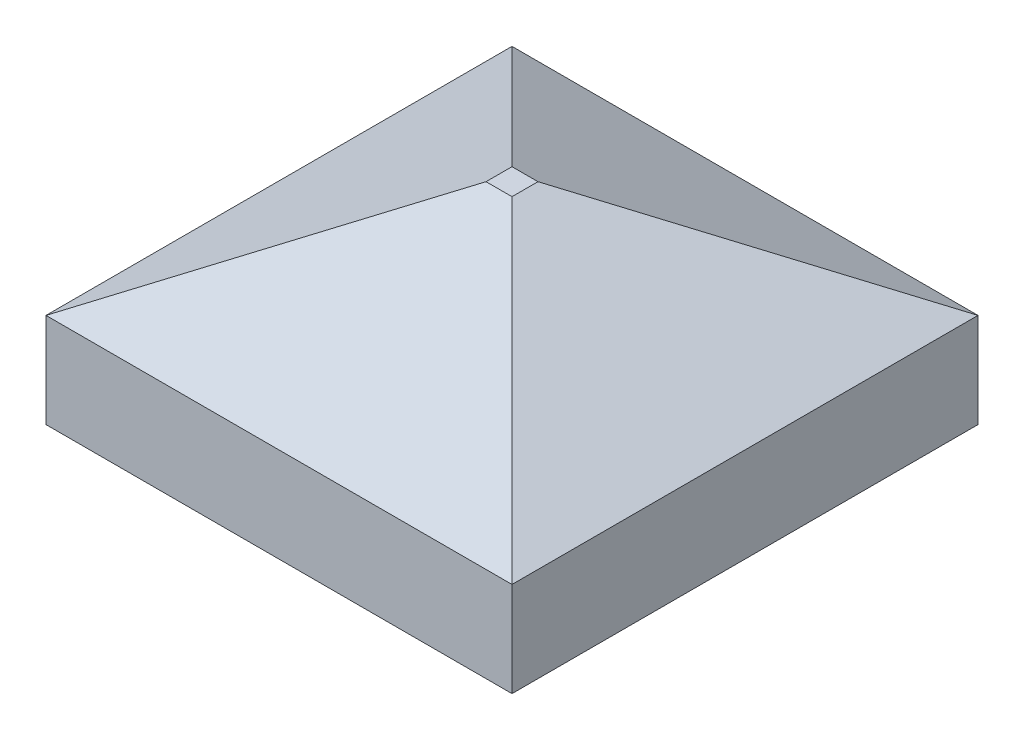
ISO-10303-21;
HEADER;
FILE_DESCRIPTION(('STEP AP214'),'2;1');
FILE_NAME('part.step','',(''),(''),'','','');
FILE_SCHEMA(('AUTOMOTIVE_DESIGN { 1 0 10303 214 1 1 1 1 }'));
ENDSEC;
DATA;
#1=APPLICATION_CONTEXT('core data for automotive mechanical design processes');
#2=APPLICATION_PROTOCOL_DEFINITION('international standard','automotive_design',2000,#1);
#3=PRODUCT_CONTEXT('',#1,'mechanical');
#4=PRODUCT('Part','Part','',(#3));
#5=PRODUCT_RELATED_PRODUCT_CATEGORY('part','',(#4));
#6=PRODUCT_DEFINITION_FORMATION('','',#4);
#7=PRODUCT_DEFINITION_CONTEXT('part definition',#1,'design');
#8=PRODUCT_DEFINITION('design','',#6,#7);
#9=PRODUCT_DEFINITION_SHAPE('','',#8);
#10=(LENGTH_UNIT() NAMED_UNIT(*) SI_UNIT(.MILLI.,.METRE.));
#11=(NAMED_UNIT(*) PLANE_ANGLE_UNIT() SI_UNIT($,.RADIAN.));
#12=(NAMED_UNIT(*) SI_UNIT($,.STERADIAN.) SOLID_ANGLE_UNIT());
#13=UNCERTAINTY_MEASURE_WITH_UNIT(LENGTH_MEASURE(1.E-05),#10,'distance_accuracy_value','');
#14=(GEOMETRIC_REPRESENTATION_CONTEXT(3) GLOBAL_UNCERTAINTY_ASSIGNED_CONTEXT((#13)) GLOBAL_UNIT_ASSIGNED_CONTEXT((#10,
#11,#12)) REPRESENTATION_CONTEXT('',''));
#15=CARTESIAN_POINT('',(0.,0.,0.));
#16=DIRECTION('',(0.,0.,1.));
#17=DIRECTION('',(1.,0.,0.));
#18=AXIS2_PLACEMENT_3D('',#15,#16,#17);
#19=CARTESIAN_POINT('',(0.,0.,0.));
#20=DIRECTION('',(0.,-1.,0.));
#21=DIRECTION('',(0.,0.,-1.));
#22=AXIS2_PLACEMENT_3D('',#19,#20,#21);
#23=PLANE('',#22);
#24=DIRECTION('',(0.,0.,-1.));
#25=VECTOR('',#24,1.);
#26=CARTESIAN_POINT('',(51.5,0.,0.));
#27=LINE('',#26,#25);
#28=CARTESIAN_POINT('',(51.5,0.,51.5));
#29=VERTEX_POINT('',#28);
#30=CARTESIAN_POINT('',(51.5,0.,-51.5));
#31=VERTEX_POINT('',#30);
#32=EDGE_CURVE('E111',#29,#31,#27,.T.);
#33=ORIENTED_EDGE('',*,*,#32,.F.);
#34=DIRECTION('',(1.,0.,0.));
#35=VECTOR('',#34,1.);
#36=CARTESIAN_POINT('',(0.,0.,51.5));
#37=LINE('',#36,#35);
#38=CARTESIAN_POINT('',(-51.5,0.,51.5));
#39=VERTEX_POINT('',#38);
#40=EDGE_CURVE('E132',#39,#29,#37,.T.);
#41=ORIENTED_EDGE('',*,*,#40,.F.);
#42=DIRECTION('',(0.,0.,1.));
#43=VECTOR('',#42,1.);
#44=CARTESIAN_POINT('',(-51.5,0.,0.));
#45=LINE('',#44,#43);
#46=CARTESIAN_POINT('',(-51.5,0.,-51.5));
#47=VERTEX_POINT('',#46);
#48=EDGE_CURVE('E113',#47,#39,#45,.T.);
#49=ORIENTED_EDGE('',*,*,#48,.F.);
#50=DIRECTION('',(-1.,0.,0.));
#51=VECTOR('',#50,1.);
#52=CARTESIAN_POINT('',(0.,0.,-51.5));
#53=LINE('',#52,#51);
#54=EDGE_CURVE('E52',#31,#47,#53,.T.);
#55=ORIENTED_EDGE('',*,*,#54,.F.);
#56=EDGE_LOOP('',(#33,#41,#49,#55));
#57=FACE_BOUND('',#56,.T.);
#58=DIRECTION('',(1.,0.,0.));
#59=VECTOR('',#58,1.);
#60=CARTESIAN_POINT('',(-50.,0.,50.));
#61=LINE('',#60,#59);
#62=CARTESIAN_POINT('',(-50.,0.,50.));
#63=VERTEX_POINT('',#62);
#64=CARTESIAN_POINT('',(50.,0.,50.));
#65=VERTEX_POINT('',#64);
#66=EDGE_CURVE('E189',#63,#65,#61,.T.);
#67=ORIENTED_EDGE('',*,*,#66,.T.);
#68=DIRECTION('',(0.,0.,-1.));
#69=VECTOR('',#68,1.);
#70=CARTESIAN_POINT('',(50.,0.,50.));
#71=LINE('',#70,#69);
#72=CARTESIAN_POINT('',(50.,0.,-50.));
#73=VERTEX_POINT('',#72);
#74=EDGE_CURVE('E211',#65,#73,#71,.T.);
#75=ORIENTED_EDGE('',*,*,#74,.T.);
#76=DIRECTION('',(-1.,0.,0.));
#77=VECTOR('',#76,1.);
#78=CARTESIAN_POINT('',(-50.,0.,-50.));
#79=LINE('',#78,#77);
#80=CARTESIAN_POINT('',(-50.,0.,-50.));
#81=VERTEX_POINT('',#80);
#82=EDGE_CURVE('E208',#73,#81,#79,.T.);
#83=ORIENTED_EDGE('',*,*,#82,.T.);
#84=DIRECTION('',(0.,0.,1.));
#85=VECTOR('',#84,1.);
#86=CARTESIAN_POINT('',(-50.,0.,50.));
#87=LINE('',#86,#85);
#88=EDGE_CURVE('E67',#81,#63,#87,.T.);
#89=ORIENTED_EDGE('',*,*,#88,.T.);
#90=EDGE_LOOP('',(#67,#75,#83,#89));
#91=FACE_BOUND('',#90,.T.);
#92=ADVANCED_FACE('F47',(#57,#91),#23,.T.);
#93=CARTESIAN_POINT('',(51.5,20.,50.));
#94=DIRECTION('',(-1.,0.,0.));
#95=DIRECTION('',(0.,0.,1.));
#96=AXIS2_PLACEMENT_3D('',#93,#94,#95);
#97=PLANE('',#96);
#98=ORIENTED_EDGE('',*,*,#32,.T.);
#99=DIRECTION('',(0.,-1.,0.));
#100=VECTOR('',#99,1.);
#101=CARTESIAN_POINT('',(51.5,20.,-51.5));
#102=LINE('',#101,#100);
#103=CARTESIAN_POINT('',(51.5,20.9055982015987,-51.5));
#104=VERTEX_POINT('',#103);
#105=EDGE_CURVE('E12',#104,#31,#102,.T.);
#106=ORIENTED_EDGE('',*,*,#105,.F.);
#107=DIRECTION('',(0.,0.,-1.));
#108=VECTOR('',#107,1.);
#109=CARTESIAN_POINT('',(51.5,20.9055982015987,0.));
#110=LINE('',#109,#108);
#111=CARTESIAN_POINT('',(51.5,20.9055982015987,51.5));
#112=VERTEX_POINT('',#111);
#113=EDGE_CURVE('E135',#112,#104,#110,.T.);
#114=ORIENTED_EDGE('',*,*,#113,.F.);
#115=DIRECTION('',(0.,-1.,0.));
#116=VECTOR('',#115,1.);
#117=CARTESIAN_POINT('',(51.5,20.,51.5));
#118=LINE('',#117,#116);
#119=EDGE_CURVE('E73',#112,#29,#118,.T.);
#120=ORIENTED_EDGE('',*,*,#119,.T.);
#121=EDGE_LOOP('',(#98,#106,#114,#120));
#122=FACE_BOUND('',#121,.T.);
#123=ADVANCED_FACE('F123',(#122),#97,.F.);
#124=CARTESIAN_POINT('',(-50.,20.,-51.5));
#125=DIRECTION('',(0.,0.,1.));
#126=DIRECTION('',(1.,0.,0.));
#127=AXIS2_PLACEMENT_3D('',#124,#125,#126);
#128=PLANE('',#127);
#129=ORIENTED_EDGE('',*,*,#54,.T.);
#130=DIRECTION('',(0.,-1.,0.));
#131=VECTOR('',#130,1.);
#132=CARTESIAN_POINT('',(-51.5,20.,-51.5));
#133=LINE('',#132,#131);
#134=CARTESIAN_POINT('',(-51.5,20.9055982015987,-51.5));
#135=VERTEX_POINT('',#134);
#136=EDGE_CURVE('E59',#135,#47,#133,.T.);
#137=ORIENTED_EDGE('',*,*,#136,.F.);
#138=DIRECTION('',(-1.,0.,0.));
#139=VECTOR('',#138,1.);
#140=CARTESIAN_POINT('',(0.,20.9055982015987,-51.5));
#141=LINE('',#140,#139);
#142=EDGE_CURVE('E124',#104,#135,#141,.T.);
#143=ORIENTED_EDGE('',*,*,#142,.F.);
#144=ORIENTED_EDGE('',*,*,#105,.T.);
#145=EDGE_LOOP('',(#129,#137,#143,#144));
#146=FACE_BOUND('',#145,.T.);
#147=ADVANCED_FACE('F120',(#146),#128,.F.);
#148=CARTESIAN_POINT('',(-51.5,20.,50.));
#149=DIRECTION('',(1.,0.,0.));
#150=DIRECTION('',(0.,0.,-1.));
#151=AXIS2_PLACEMENT_3D('',#148,#149,#150);
#152=PLANE('',#151);
#153=ORIENTED_EDGE('',*,*,#48,.T.);
#154=DIRECTION('',(0.,-1.,0.));
#155=VECTOR('',#154,1.);
#156=CARTESIAN_POINT('',(-51.5,20.,51.5));
#157=LINE('',#156,#155);
#158=CARTESIAN_POINT('',(-51.5,20.9055982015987,51.5));
#159=VERTEX_POINT('',#158);
#160=EDGE_CURVE('E138',#159,#39,#157,.T.);
#161=ORIENTED_EDGE('',*,*,#160,.F.);
#162=DIRECTION('',(0.,0.,1.));
#163=VECTOR('',#162,1.);
#164=CARTESIAN_POINT('',(-51.5,20.9055982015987,0.));
#165=LINE('',#164,#163);
#166=EDGE_CURVE('E149',#135,#159,#165,.T.);
#167=ORIENTED_EDGE('',*,*,#166,.F.);
#168=ORIENTED_EDGE('',*,*,#136,.T.);
#169=EDGE_LOOP('',(#153,#161,#167,#168));
#170=FACE_BOUND('',#169,.T.);
#171=ADVANCED_FACE('F137',(#170),#152,.F.);
#172=CARTESIAN_POINT('',(-50.,20.,51.5));
#173=DIRECTION('',(0.,0.,-1.));
#174=DIRECTION('',(-1.,0.,0.));
#175=AXIS2_PLACEMENT_3D('',#172,#173,#174);
#176=PLANE('',#175);
#177=ORIENTED_EDGE('',*,*,#40,.T.);
#178=ORIENTED_EDGE('',*,*,#119,.F.);
#179=DIRECTION('',(1.,0.,0.));
#180=VECTOR('',#179,1.);
#181=CARTESIAN_POINT('',(0.,20.9055982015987,51.5));
#182=LINE('',#181,#180);
#183=EDGE_CURVE('E142',#159,#112,#182,.T.);
#184=ORIENTED_EDGE('',*,*,#183,.F.);
#185=ORIENTED_EDGE('',*,*,#160,.T.);
#186=EDGE_LOOP('',(#177,#178,#184,#185));
#187=FACE_BOUND('',#186,.T.);
#188=ADVANCED_FACE('F140',(#187),#176,.F.);
#189=CARTESIAN_POINT('',(0.,46.5,0.));
#190=DIRECTION('',(0.,-1.,0.));
#191=DIRECTION('',(0.,0.,-1.));
#192=AXIS2_PLACEMENT_3D('',#189,#190,#191);
#193=PLANE('',#192);
#194=DIRECTION('',(0.,0.,-1.));
#195=VECTOR('',#194,1.);
#196=CARTESIAN_POINT('',(2.87063658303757,46.5,0.));
#197=LINE('',#196,#195);
#198=CARTESIAN_POINT('',(2.87063658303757,46.5,2.87063658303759));
#199=VERTEX_POINT('',#198);
#200=CARTESIAN_POINT('',(2.87063658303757,46.5,-2.87063658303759));
#201=VERTEX_POINT('',#200);
#202=EDGE_CURVE('E159',#199,#201,#197,.T.);
#203=ORIENTED_EDGE('',*,*,#202,.T.);
#204=DIRECTION('',(-1.,0.,0.));
#205=VECTOR('',#204,1.);
#206=CARTESIAN_POINT('',(0.,46.5,-2.87063658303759));
#207=LINE('',#206,#205);
#208=CARTESIAN_POINT('',(-2.87063658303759,46.5,-2.87063658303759));
#209=VERTEX_POINT('',#208);
#210=EDGE_CURVE('E162',#201,#209,#207,.T.);
#211=ORIENTED_EDGE('',*,*,#210,.T.);
#212=DIRECTION('',(0.,0.,1.));
#213=VECTOR('',#212,1.);
#214=CARTESIAN_POINT('',(-2.87063658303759,46.5,0.));
#215=LINE('',#214,#213);
#216=CARTESIAN_POINT('',(-2.87063658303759,46.5,2.87063658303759));
#217=VERTEX_POINT('',#216);
#218=EDGE_CURVE('E158',#209,#217,#215,.T.);
#219=ORIENTED_EDGE('',*,*,#218,.T.);
#220=DIRECTION('',(1.,0.,0.));
#221=VECTOR('',#220,1.);
#222=CARTESIAN_POINT('',(0.,46.5,2.87063658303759));
#223=LINE('',#222,#221);
#224=EDGE_CURVE('E156',#217,#199,#223,.T.);
#225=ORIENTED_EDGE('',*,*,#224,.T.);
#226=EDGE_LOOP('',(#203,#211,#219,#225));
#227=FACE_BOUND('',#226,.T.);
#228=ADVANCED_FACE('F166',(#227),#193,.F.);
#229=CARTESIAN_POINT('',(0.,37.5963578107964,19.7875567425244));
#230=DIRECTION('',(0.,-0.884918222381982,-0.465746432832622));
#231=DIRECTION('',(0.,0.465746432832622,-0.884918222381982));
#232=AXIS2_PLACEMENT_3D('',#229,#230,#231);
#233=PLANE('',#232);
#234=DIRECTION('',(-0.662701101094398,0.348790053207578,-0.662701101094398));
#235=VECTOR('',#234,1.);
#236=CARTESIAN_POINT('',(11.0974010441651,42.1701239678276,11.0974010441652));
#237=LINE('',#236,#235);
#238=EDGE_CURVE('E155',#112,#199,#237,.T.);
#239=ORIENTED_EDGE('',*,*,#238,.T.);
#240=ORIENTED_EDGE('',*,*,#224,.F.);
#241=DIRECTION('',(0.662701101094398,0.348790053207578,-0.662701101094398));
#242=VECTOR('',#241,1.);
#243=CARTESIAN_POINT('',(-11.0974010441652,42.1701239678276,11.0974010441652));
#244=LINE('',#243,#242);
#245=EDGE_CURVE('E154',#159,#217,#244,.T.);
#246=ORIENTED_EDGE('',*,*,#245,.F.);
#247=ORIENTED_EDGE('',*,*,#183,.T.);
#248=EDGE_LOOP('',(#239,#240,#246,#247));
#249=FACE_BOUND('',#248,.T.);
#250=ADVANCED_FACE('F399',(#249),#233,.F.);
#251=CARTESIAN_POINT('',(-19.7875567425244,37.5963578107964,0.));
#252=DIRECTION('',(0.465746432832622,-0.884918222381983,0.));
#253=DIRECTION('',(0.884918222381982,0.465746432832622,0.));
#254=AXIS2_PLACEMENT_3D('',#251,#252,#253);
#255=PLANE('',#254);
#256=ORIENTED_EDGE('',*,*,#245,.T.);
#257=ORIENTED_EDGE('',*,*,#218,.F.);
#258=DIRECTION('',(0.662701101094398,0.348790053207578,0.662701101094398));
#259=VECTOR('',#258,1.);
#260=CARTESIAN_POINT('',(-11.0974010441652,42.1701239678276,-11.0974010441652));
#261=LINE('',#260,#259);
#262=EDGE_CURVE('E127',#135,#209,#261,.T.);
#263=ORIENTED_EDGE('',*,*,#262,.F.);
#264=ORIENTED_EDGE('',*,*,#166,.T.);
#265=EDGE_LOOP('',(#256,#257,#263,#264));
#266=FACE_BOUND('',#265,.T.);
#267=ADVANCED_FACE('F173',(#266),#255,.F.);
#268=CARTESIAN_POINT('',(19.7875567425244,37.5963578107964,0.));
#269=DIRECTION('',(-0.465746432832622,-0.884918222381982,0.));
#270=DIRECTION('',(0.884918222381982,-0.465746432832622,0.));
#271=AXIS2_PLACEMENT_3D('',#268,#269,#270);
#272=PLANE('',#271);
#273=DIRECTION('',(-0.662701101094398,0.348790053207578,0.662701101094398));
#274=VECTOR('',#273,1.);
#275=CARTESIAN_POINT('',(11.0974010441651,42.1701239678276,-11.0974010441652));
#276=LINE('',#275,#274);
#277=EDGE_CURVE('E129',#104,#201,#276,.T.);
#278=ORIENTED_EDGE('',*,*,#277,.T.);
#279=ORIENTED_EDGE('',*,*,#202,.F.);
#280=ORIENTED_EDGE('',*,*,#238,.F.);
#281=ORIENTED_EDGE('',*,*,#113,.T.);
#282=EDGE_LOOP('',(#278,#279,#280,#281));
#283=FACE_BOUND('',#282,.T.);
#284=ADVANCED_FACE('F405',(#283),#272,.F.);
#285=CARTESIAN_POINT('',(0.,37.5963578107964,-19.7875567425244));
#286=DIRECTION('',(0.,-0.884918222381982,0.465746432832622));
#287=DIRECTION('',(0.,-0.465746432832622,-0.884918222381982));
#288=AXIS2_PLACEMENT_3D('',#285,#286,#287);
#289=PLANE('',#288);
#290=ORIENTED_EDGE('',*,*,#262,.T.);
#291=ORIENTED_EDGE('',*,*,#210,.F.);
#292=ORIENTED_EDGE('',*,*,#277,.F.);
#293=ORIENTED_EDGE('',*,*,#142,.T.);
#294=EDGE_LOOP('',(#290,#291,#292,#293));
#295=FACE_BOUND('',#294,.T.);
#296=ADVANCED_FACE('F51',(#295),#289,.F.);
#297=CARTESIAN_POINT('',(50.,20.,50.));
#298=DIRECTION('',(-1.,0.,0.));
#299=DIRECTION('',(0.,0.,1.));
#300=AXIS2_PLACEMENT_3D('',#297,#298,#299);
#301=PLANE('',#300);
#302=ORIENTED_EDGE('',*,*,#74,.F.);
#303=DIRECTION('',(0.,-1.,0.));
#304=VECTOR('',#303,1.);
#305=CARTESIAN_POINT('',(50.,20.,50.));
#306=LINE('',#305,#304);
#307=CARTESIAN_POINT('',(50.,20.,50.));
#308=VERTEX_POINT('',#307);
#309=EDGE_CURVE('E191',#308,#65,#306,.T.);
#310=ORIENTED_EDGE('',*,*,#309,.F.);
#311=DIRECTION('',(0.,0.,1.));
#312=VECTOR('',#311,1.);
#313=CARTESIAN_POINT('',(50.,20.,0.));
#314=LINE('',#313,#312);
#315=CARTESIAN_POINT('',(50.,20.,-50.));
#316=VERTEX_POINT('',#315);
#317=EDGE_CURVE('E181',#308,#316,#314,.F.);
#318=ORIENTED_EDGE('',*,*,#317,.T.);
#319=DIRECTION('',(0.,-1.,0.));
#320=VECTOR('',#319,1.);
#321=CARTESIAN_POINT('',(50.,20.,-50.));
#322=LINE('',#321,#320);
#323=EDGE_CURVE('E163',#316,#73,#322,.T.);
#324=ORIENTED_EDGE('',*,*,#323,.T.);
#325=EDGE_LOOP('',(#302,#310,#318,#324));
#326=FACE_BOUND('',#325,.T.);
#327=ADVANCED_FACE('F355',(#326),#301,.T.);
#328=CARTESIAN_POINT('',(-50.,20.,-50.));
#329=DIRECTION('',(0.,0.,1.));
#330=DIRECTION('',(1.,0.,0.));
#331=AXIS2_PLACEMENT_3D('',#328,#329,#330);
#332=PLANE('',#331);
#333=ORIENTED_EDGE('',*,*,#82,.F.);
#334=ORIENTED_EDGE('',*,*,#323,.F.);
#335=DIRECTION('',(1.,0.,0.));
#336=VECTOR('',#335,1.);
#337=CARTESIAN_POINT('',(0.,20.,-50.));
#338=LINE('',#337,#336);
#339=CARTESIAN_POINT('',(-50.,20.,-50.));
#340=VERTEX_POINT('',#339);
#341=EDGE_CURVE('E188',#316,#340,#338,.F.);
#342=ORIENTED_EDGE('',*,*,#341,.T.);
#343=DIRECTION('',(0.,-1.,0.));
#344=VECTOR('',#343,1.);
#345=CARTESIAN_POINT('',(-50.,20.,-50.));
#346=LINE('',#345,#344);
#347=EDGE_CURVE('E197',#340,#81,#346,.T.);
#348=ORIENTED_EDGE('',*,*,#347,.T.);
#349=EDGE_LOOP('',(#333,#334,#342,#348));
#350=FACE_BOUND('',#349,.T.);
#351=ADVANCED_FACE('F406',(#350),#332,.T.);
#352=CARTESIAN_POINT('',(-50.,20.,50.));
#353=DIRECTION('',(1.,0.,0.));
#354=DIRECTION('',(0.,0.,-1.));
#355=AXIS2_PLACEMENT_3D('',#352,#353,#354);
#356=PLANE('',#355);
#357=ORIENTED_EDGE('',*,*,#88,.F.);
#358=ORIENTED_EDGE('',*,*,#347,.F.);
#359=DIRECTION('',(0.,0.,1.));
#360=VECTOR('',#359,1.);
#361=CARTESIAN_POINT('',(-50.,20.,0.));
#362=LINE('',#361,#360);
#363=CARTESIAN_POINT('',(-50.,20.,50.));
#364=VERTEX_POINT('',#363);
#365=EDGE_CURVE('E192',#340,#364,#362,.T.);
#366=ORIENTED_EDGE('',*,*,#365,.T.);
#367=DIRECTION('',(0.,-1.,0.));
#368=VECTOR('',#367,1.);
#369=CARTESIAN_POINT('',(-50.,20.,50.));
#370=LINE('',#369,#368);
#371=EDGE_CURVE('E200',#364,#63,#370,.T.);
#372=ORIENTED_EDGE('',*,*,#371,.T.);
#373=EDGE_LOOP('',(#357,#358,#366,#372));
#374=FACE_BOUND('',#373,.T.);
#375=ADVANCED_FACE('F413',(#374),#356,.T.);
#376=CARTESIAN_POINT('',(-50.,20.,50.));
#377=DIRECTION('',(0.,0.,-1.));
#378=DIRECTION('',(-1.,0.,0.));
#379=AXIS2_PLACEMENT_3D('',#376,#377,#378);
#380=PLANE('',#379);
#381=ORIENTED_EDGE('',*,*,#66,.F.);
#382=ORIENTED_EDGE('',*,*,#371,.F.);
#383=DIRECTION('',(1.,0.,0.));
#384=VECTOR('',#383,1.);
#385=CARTESIAN_POINT('',(0.,20.,50.));
#386=LINE('',#385,#384);
#387=EDGE_CURVE('E187',#364,#308,#386,.T.);
#388=ORIENTED_EDGE('',*,*,#387,.T.);
#389=ORIENTED_EDGE('',*,*,#309,.T.);
#390=EDGE_LOOP('',(#381,#382,#388,#389));
#391=FACE_BOUND('',#390,.T.);
#392=ADVANCED_FACE('F232',(#391),#380,.T.);
#393=CARTESIAN_POINT('',(0.,45.,0.));
#394=DIRECTION('',(0.,-1.,0.));
#395=DIRECTION('',(0.,0.,-1.));
#396=AXIS2_PLACEMENT_3D('',#393,#394,#395);
#397=PLANE('',#396);
#398=DIRECTION('',(0.,0.,-1.));
#399=VECTOR('',#398,1.);
#400=CARTESIAN_POINT('',(2.5,45.,2.5));
#401=LINE('',#400,#399);
#402=CARTESIAN_POINT('',(2.5,45.,2.5));
#403=VERTEX_POINT('',#402);
#404=CARTESIAN_POINT('',(2.5,45.,-2.5));
#405=VERTEX_POINT('',#404);
#406=EDGE_CURVE('E265',#403,#405,#401,.T.);
#407=ORIENTED_EDGE('',*,*,#406,.F.);
#408=DIRECTION('',(1.,0.,0.));
#409=VECTOR('',#408,1.);
#410=CARTESIAN_POINT('',(-2.5,45.,2.5));
#411=LINE('',#410,#409);
#412=CARTESIAN_POINT('',(-2.5,45.,2.5));
#413=VERTEX_POINT('',#412);
#414=EDGE_CURVE('E266',#413,#403,#411,.T.);
#415=ORIENTED_EDGE('',*,*,#414,.F.);
#416=DIRECTION('',(0.,0.,1.));
#417=VECTOR('',#416,1.);
#418=CARTESIAN_POINT('',(-2.5,45.,2.5));
#419=LINE('',#418,#417);
#420=CARTESIAN_POINT('',(-2.5,45.,-2.5));
#421=VERTEX_POINT('',#420);
#422=EDGE_CURVE('E261',#421,#413,#419,.T.);
#423=ORIENTED_EDGE('',*,*,#422,.F.);
#424=DIRECTION('',(-1.,0.,0.));
#425=VECTOR('',#424,1.);
#426=CARTESIAN_POINT('',(-2.5,45.,-2.5));
#427=LINE('',#426,#425);
#428=EDGE_CURVE('E255',#405,#421,#427,.T.);
#429=ORIENTED_EDGE('',*,*,#428,.F.);
#430=EDGE_LOOP('',(#407,#415,#423,#429));
#431=FACE_BOUND('',#430,.T.);
#432=ADVANCED_FACE('F222',(#431),#397,.T.);
#433=CARTESIAN_POINT('',(0.,36.2689804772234,19.0889370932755));
#434=DIRECTION('',(0.,-0.884918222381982,-0.465746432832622));
#435=DIRECTION('',(0.,0.465746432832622,-0.884918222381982));
#436=AXIS2_PLACEMENT_3D('',#433,#434,#435);
#437=PLANE('',#436);
#438=DIRECTION('',(-0.662701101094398,0.348790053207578,-0.662701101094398));
#439=VECTOR('',#438,1.);
#440=CARTESIAN_POINT('',(50.,20.,50.));
#441=LINE('',#440,#439);
#442=EDGE_CURVE('E285',#308,#403,#441,.T.);
#443=ORIENTED_EDGE('',*,*,#442,.F.);
#444=ORIENTED_EDGE('',*,*,#387,.F.);
#445=DIRECTION('',(0.662701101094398,0.348790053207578,-0.662701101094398));
#446=VECTOR('',#445,1.);
#447=CARTESIAN_POINT('',(-50.,20.,50.));
#448=LINE('',#447,#446);
#449=EDGE_CURVE('E291',#364,#413,#448,.T.);
#450=ORIENTED_EDGE('',*,*,#449,.T.);
#451=ORIENTED_EDGE('',*,*,#414,.T.);
#452=EDGE_LOOP('',(#443,#444,#450,#451));
#453=FACE_BOUND('',#452,.T.);
#454=ADVANCED_FACE('F230',(#453),#437,.T.);
#455=CARTESIAN_POINT('',(-19.0889370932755,36.2689804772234,0.));
#456=DIRECTION('',(0.465746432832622,-0.884918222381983,0.));
#457=DIRECTION('',(0.884918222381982,0.465746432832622,0.));
#458=AXIS2_PLACEMENT_3D('',#455,#456,#457);
#459=PLANE('',#458);
#460=ORIENTED_EDGE('',*,*,#449,.F.);
#461=ORIENTED_EDGE('',*,*,#365,.F.);
#462=DIRECTION('',(0.662701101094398,0.348790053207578,0.662701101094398));
#463=VECTOR('',#462,1.);
#464=CARTESIAN_POINT('',(-50.,20.,-50.));
#465=LINE('',#464,#463);
#466=EDGE_CURVE('E212',#340,#421,#465,.T.);
#467=ORIENTED_EDGE('',*,*,#466,.T.);
#468=ORIENTED_EDGE('',*,*,#422,.T.);
#469=EDGE_LOOP('',(#460,#461,#467,#468));
#470=FACE_BOUND('',#469,.T.);
#471=ADVANCED_FACE('F288',(#470),#459,.T.);
#472=CARTESIAN_POINT('',(19.0889370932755,36.2689804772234,0.));
#473=DIRECTION('',(-0.465746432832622,-0.884918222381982,0.));
#474=DIRECTION('',(0.884918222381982,-0.465746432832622,0.));
#475=AXIS2_PLACEMENT_3D('',#472,#473,#474);
#476=PLANE('',#475);
#477=DIRECTION('',(-0.662701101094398,0.348790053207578,0.662701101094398));
#478=VECTOR('',#477,1.);
#479=CARTESIAN_POINT('',(50.,20.,-50.));
#480=LINE('',#479,#478);
#481=EDGE_CURVE('E334',#316,#405,#480,.T.);
#482=ORIENTED_EDGE('',*,*,#481,.F.);
#483=ORIENTED_EDGE('',*,*,#317,.F.);
#484=ORIENTED_EDGE('',*,*,#442,.T.);
#485=ORIENTED_EDGE('',*,*,#406,.T.);
#486=EDGE_LOOP('',(#482,#483,#484,#485));
#487=FACE_BOUND('',#486,.T.);
#488=ADVANCED_FACE('F309',(#487),#476,.T.);
#489=CARTESIAN_POINT('',(0.,36.2689804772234,-19.0889370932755));
#490=DIRECTION('',(0.,-0.884918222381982,0.465746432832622));
#491=DIRECTION('',(0.,-0.465746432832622,-0.884918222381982));
#492=AXIS2_PLACEMENT_3D('',#489,#490,#491);
#493=PLANE('',#492);
#494=ORIENTED_EDGE('',*,*,#466,.F.);
#495=ORIENTED_EDGE('',*,*,#341,.F.);
#496=ORIENTED_EDGE('',*,*,#481,.T.);
#497=ORIENTED_EDGE('',*,*,#428,.T.);
#498=EDGE_LOOP('',(#494,#495,#496,#497));
#499=FACE_BOUND('',#498,.T.);
#500=ADVANCED_FACE('F311',(#499),#493,.T.);
#501=CLOSED_SHELL('',(#92,#123,#147,#171,#188,#228,#250,#267,#284,#296,#327,#351,#375,#392,#432,
#454,#471,#488,#500));
#502=MANIFOLD_SOLID_BREP('B2',#501);
#503=ADVANCED_BREP_SHAPE_REPRESENTATION('',(#18,#502),#14);
#504=SHAPE_DEFINITION_REPRESENTATION(#9,#503);
ENDSEC;
END-ISO-10303-21;
